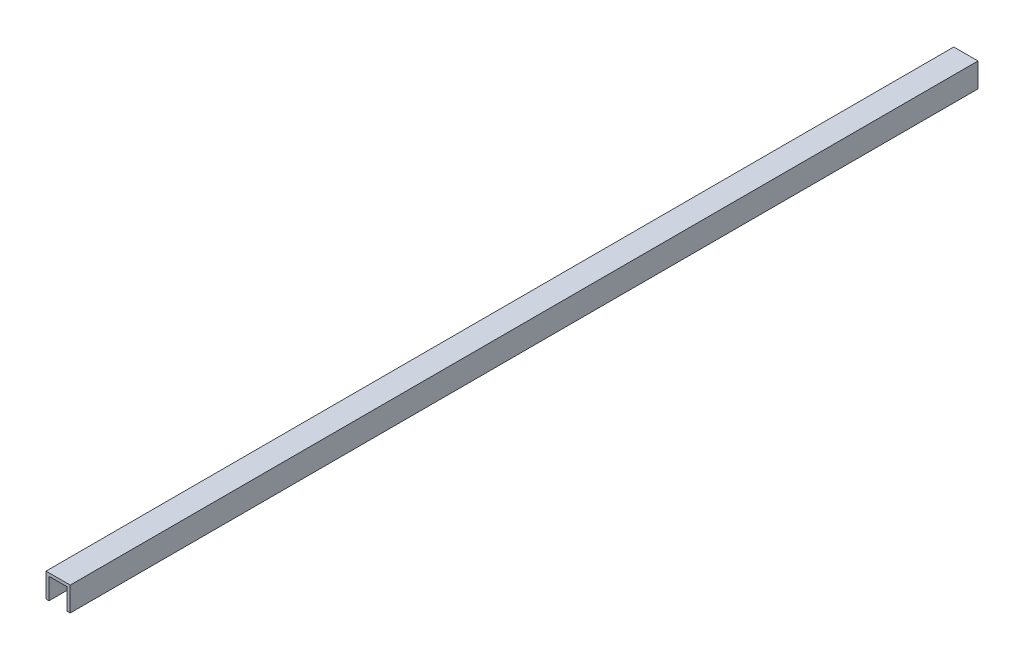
from build123d import *

# Parameters (mm, degrees)
SKIZZE1_W                       = 8
SKIZZE1_H                       = 8
AUFSATZ_LINEAR_AUSTRAGEN1_DEPTH = 150
WANDUNG1_T                      = -1


with BuildPart() as part:
    # Skizze1 → Aufsatz-Linear austragen1 (new, symmetric)
    with BuildSketch(Plane.XY):
        Rectangle(SKIZZE1_W, SKIZZE1_H)
    extrude(amount=AUFSATZ_LINEAR_AUSTRAGEN1_DEPTH, both=True)

    # Wandung1
    wandung1_openings = [part.faces().sort_by_distance(p)[0] for p in [
        (0, 0, 150),
        (0, 0, -150),
        (0, -4, 0),
    ]]
    offset(amount=WANDUNG1_T, openings=wandung1_openings, kind=Kind.INTERSECTION)


solid = part.part
